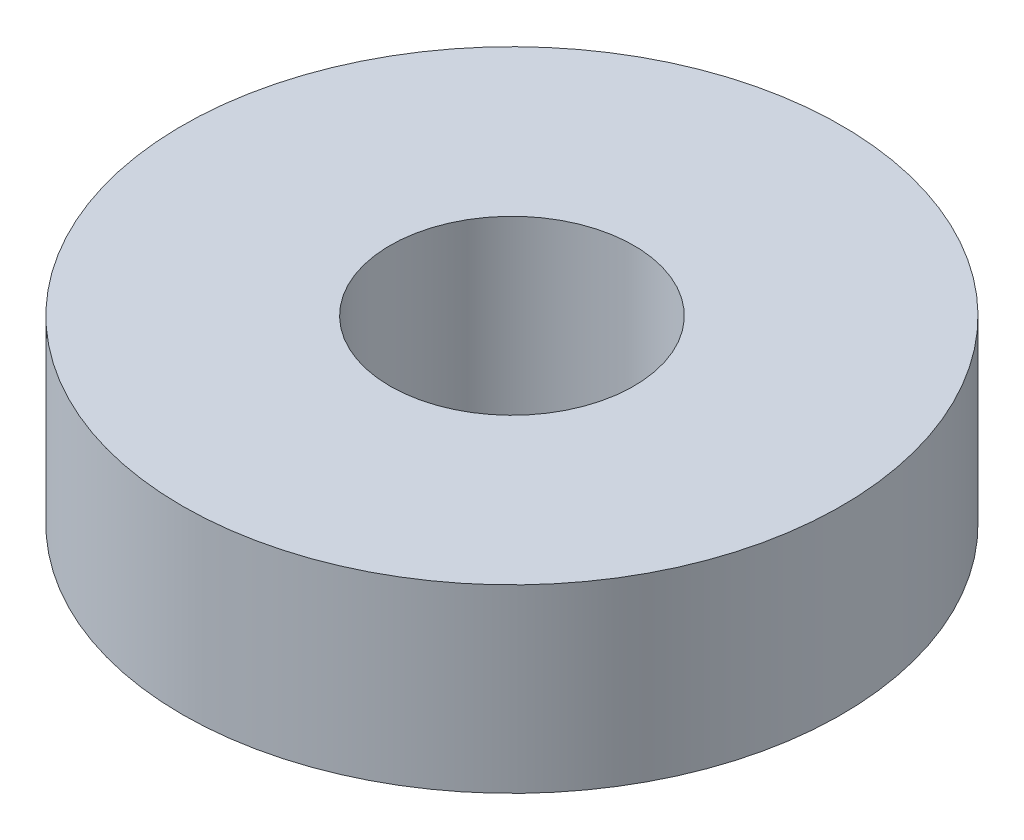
ISO-10303-21;
HEADER;
FILE_DESCRIPTION(('STEP AP214'),'2;1');
FILE_NAME('part.step','',(''),(''),'','','');
FILE_SCHEMA(('AUTOMOTIVE_DESIGN { 1 0 10303 214 1 1 1 1 }'));
ENDSEC;
DATA;
#1=APPLICATION_CONTEXT('core data for automotive mechanical design processes');
#2=APPLICATION_PROTOCOL_DEFINITION('international standard','automotive_design',2000,#1);
#3=PRODUCT_CONTEXT('',#1,'mechanical');
#4=PRODUCT('Part','Part','',(#3));
#5=PRODUCT_RELATED_PRODUCT_CATEGORY('part','',(#4));
#6=PRODUCT_DEFINITION_FORMATION('','',#4);
#7=PRODUCT_DEFINITION_CONTEXT('part definition',#1,'design');
#8=PRODUCT_DEFINITION('design','',#6,#7);
#9=PRODUCT_DEFINITION_SHAPE('','',#8);
#10=(LENGTH_UNIT() NAMED_UNIT(*) SI_UNIT(.MILLI.,.METRE.));
#11=(NAMED_UNIT(*) PLANE_ANGLE_UNIT() SI_UNIT($,.RADIAN.));
#12=(NAMED_UNIT(*) SI_UNIT($,.STERADIAN.) SOLID_ANGLE_UNIT());
#13=UNCERTAINTY_MEASURE_WITH_UNIT(LENGTH_MEASURE(1.E-05),#10,'distance_accuracy_value','');
#14=(GEOMETRIC_REPRESENTATION_CONTEXT(3) GLOBAL_UNCERTAINTY_ASSIGNED_CONTEXT((#13)) GLOBAL_UNIT_ASSIGNED_CONTEXT((#10,
#11,#12)) REPRESENTATION_CONTEXT('',''));
#15=CARTESIAN_POINT('',(0.,0.,0.));
#16=DIRECTION('',(0.,0.,1.));
#17=DIRECTION('',(1.,0.,0.));
#18=AXIS2_PLACEMENT_3D('',#15,#16,#17);
#19=CARTESIAN_POINT('',(0.,5.08,0.));
#20=DIRECTION('',(0.,1.,0.));
#21=DIRECTION('',(0.,0.,1.));
#22=AXIS2_PLACEMENT_3D('',#19,#20,#21);
#23=PLANE('',#22);
#24=CARTESIAN_POINT('',(0.,5.08,0.));
#25=DIRECTION('',(0.,1.,0.));
#26=DIRECTION('',(0.,0.,1.));
#27=AXIS2_PLACEMENT_3D('',#24,#25,#26);
#28=CIRCLE('',#27,9.271);
#29=CARTESIAN_POINT('',(0.,5.08,9.271));
#30=VERTEX_POINT('',#29);
#31=EDGE_CURVE('E10',#30,#30,#28,.T.);
#32=ORIENTED_EDGE('',*,*,#31,.T.);
#33=EDGE_LOOP('',(#32));
#34=FACE_BOUND('',#33,.T.);
#35=CARTESIAN_POINT('',(0.,5.08,0.));
#36=DIRECTION('',(0.,1.,0.));
#37=DIRECTION('',(0.,0.,1.));
#38=AXIS2_PLACEMENT_3D('',#35,#36,#37);
#39=CIRCLE('',#38,3.429);
#40=CARTESIAN_POINT('',(0.,5.08,3.429));
#41=VERTEX_POINT('',#40);
#42=EDGE_CURVE('E42',#41,#41,#39,.T.);
#43=ORIENTED_EDGE('',*,*,#42,.F.);
#44=EDGE_LOOP('',(#43));
#45=FACE_BOUND('',#44,.T.);
#46=ADVANCED_FACE('F31',(#34,#45),#23,.T.);
#47=CARTESIAN_POINT('',(0.,0.,0.));
#48=DIRECTION('',(0.,1.,0.));
#49=DIRECTION('',(0.,0.,1.));
#50=AXIS2_PLACEMENT_3D('',#47,#48,#49);
#51=PLANE('',#50);
#52=CARTESIAN_POINT('',(0.,0.,0.));
#53=DIRECTION('',(0.,1.,0.));
#54=DIRECTION('',(0.,0.,1.));
#55=AXIS2_PLACEMENT_3D('',#52,#53,#54);
#56=CIRCLE('',#55,9.271);
#57=CARTESIAN_POINT('',(0.,0.,9.271));
#58=VERTEX_POINT('',#57);
#59=EDGE_CURVE('E35',#58,#58,#56,.T.);
#60=ORIENTED_EDGE('',*,*,#59,.F.);
#61=EDGE_LOOP('',(#60));
#62=FACE_BOUND('',#61,.T.);
#63=CARTESIAN_POINT('',(0.,0.,0.));
#64=DIRECTION('',(0.,1.,0.));
#65=DIRECTION('',(0.,0.,1.));
#66=AXIS2_PLACEMENT_3D('',#63,#64,#65);
#67=CIRCLE('',#66,3.429);
#68=CARTESIAN_POINT('',(0.,0.,3.429));
#69=VERTEX_POINT('',#68);
#70=EDGE_CURVE('E44',#69,#69,#67,.T.);
#71=ORIENTED_EDGE('',*,*,#70,.T.);
#72=EDGE_LOOP('',(#71));
#73=FACE_BOUND('',#72,.T.);
#74=ADVANCED_FACE('F54',(#62,#73),#51,.F.);
#75=CARTESIAN_POINT('',(0.,5.08,0.));
#76=DIRECTION('',(0.,-1.,0.));
#77=DIRECTION('',(0.,0.,-1.));
#78=AXIS2_PLACEMENT_3D('',#75,#76,#77);
#79=CYLINDRICAL_SURFACE('',#78,9.271);
#80=ORIENTED_EDGE('',*,*,#31,.F.);
#81=EDGE_LOOP('',(#80));
#82=FACE_BOUND('',#81,.T.);
#83=ORIENTED_EDGE('',*,*,#59,.T.);
#84=EDGE_LOOP('',(#83));
#85=FACE_BOUND('',#84,.T.);
#86=ADVANCED_FACE('F33',(#82,#85),#79,.T.);
#87=CARTESIAN_POINT('',(0.,5.08,0.));
#88=DIRECTION('',(0.,-1.,0.));
#89=DIRECTION('',(0.,0.,-1.));
#90=AXIS2_PLACEMENT_3D('',#87,#88,#89);
#91=CYLINDRICAL_SURFACE('',#90,3.429);
#92=ORIENTED_EDGE('',*,*,#42,.T.);
#93=EDGE_LOOP('',(#92));
#94=FACE_BOUND('',#93,.T.);
#95=ORIENTED_EDGE('',*,*,#70,.F.);
#96=EDGE_LOOP('',(#95));
#97=FACE_BOUND('',#96,.T.);
#98=ADVANCED_FACE('F50',(#94,#97),#91,.F.);
#99=CLOSED_SHELL('',(#46,#74,#86,#98));
#100=MANIFOLD_SOLID_BREP('B2',#99);
#101=ADVANCED_BREP_SHAPE_REPRESENTATION('',(#18,#100),#14);
#102=SHAPE_DEFINITION_REPRESENTATION(#9,#101);
ENDSEC;
END-ISO-10303-21;
